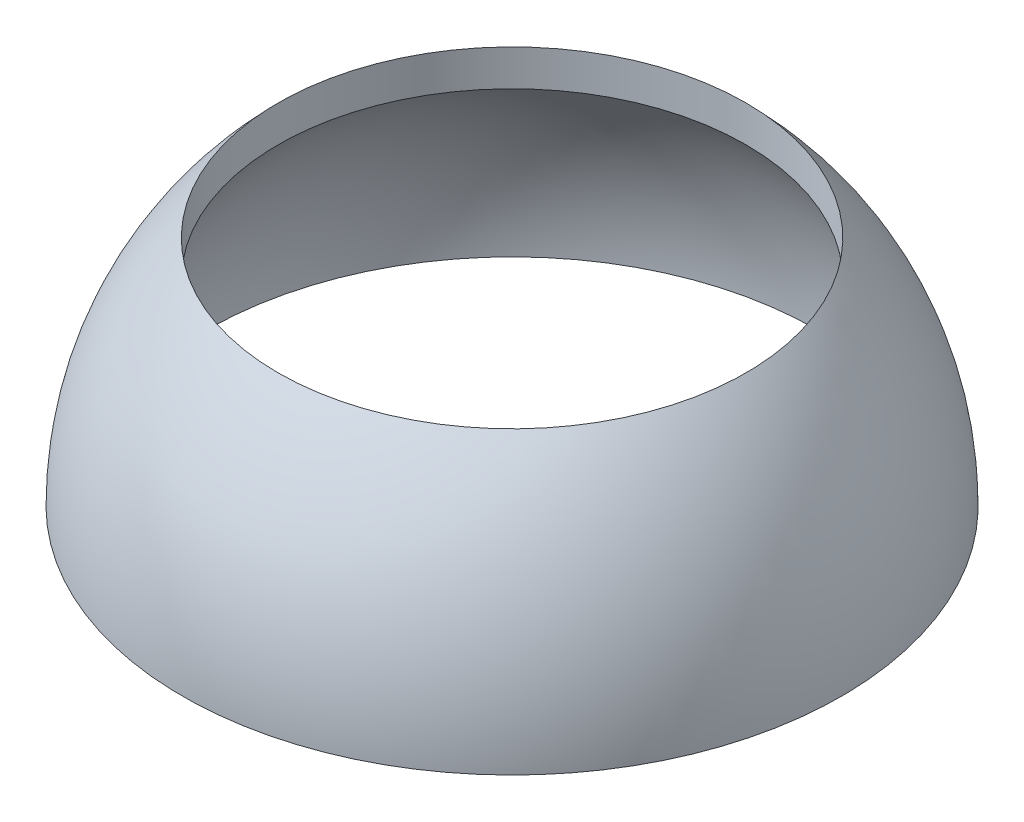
ISO-10303-21;
HEADER;
FILE_DESCRIPTION(('STEP AP214'),'2;1');
FILE_NAME('part.step','',(''),(''),'','','');
FILE_SCHEMA(('AUTOMOTIVE_DESIGN { 1 0 10303 214 1 1 1 1 }'));
ENDSEC;
DATA;
#1=APPLICATION_CONTEXT('core data for automotive mechanical design processes');
#2=APPLICATION_PROTOCOL_DEFINITION('international standard','automotive_design',2000,#1);
#3=PRODUCT_CONTEXT('',#1,'mechanical');
#4=PRODUCT('Part','Part','',(#3));
#5=PRODUCT_RELATED_PRODUCT_CATEGORY('part','',(#4));
#6=PRODUCT_DEFINITION_FORMATION('','',#4);
#7=PRODUCT_DEFINITION_CONTEXT('part definition',#1,'design');
#8=PRODUCT_DEFINITION('design','',#6,#7);
#9=PRODUCT_DEFINITION_SHAPE('','',#8);
#10=(LENGTH_UNIT() NAMED_UNIT(*) SI_UNIT(.MILLI.,.METRE.));
#11=(NAMED_UNIT(*) PLANE_ANGLE_UNIT() SI_UNIT($,.RADIAN.));
#12=(NAMED_UNIT(*) SI_UNIT($,.STERADIAN.) SOLID_ANGLE_UNIT());
#13=UNCERTAINTY_MEASURE_WITH_UNIT(LENGTH_MEASURE(1.E-05),#10,'distance_accuracy_value','');
#14=(GEOMETRIC_REPRESENTATION_CONTEXT(3) GLOBAL_UNCERTAINTY_ASSIGNED_CONTEXT((#13)) GLOBAL_UNIT_ASSIGNED_CONTEXT((#10,
#11,#12)) REPRESENTATION_CONTEXT('',''));
#15=CARTESIAN_POINT('',(0.,0.,0.));
#16=DIRECTION('',(0.,0.,1.));
#17=DIRECTION('',(1.,0.,0.));
#18=AXIS2_PLACEMENT_3D('',#15,#16,#17);
#19=CARTESIAN_POINT('',(0.,0.,0.));
#20=DIRECTION('',(0.,-1.,0.));
#21=DIRECTION('',(1.,0.,0.));
#22=AXIS2_PLACEMENT_3D('',#19,#20,#21);
#23=SPHERICAL_SURFACE('',#22,14.35);
#24=CARTESIAN_POINT('',(0.,9.21534047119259,0.));
#25=DIRECTION('',(0.,-1.,0.));
#26=DIRECTION('',(0.,0.,-1.));
#27=AXIS2_PLACEMENT_3D('',#24,#25,#26);
#28=CIRCLE('',#27,11.);
#29=CARTESIAN_POINT('',(0.,9.21534047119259,-11.));
#30=VERTEX_POINT('',#29);
#31=EDGE_CURVE('E39',#30,#30,#28,.F.);
#32=ORIENTED_EDGE('',*,*,#31,.T.);
#33=EDGE_LOOP('',(#32));
#34=FACE_BOUND('',#33,.T.);
#35=CARTESIAN_POINT('',(0.,0.,0.));
#36=DIRECTION('',(0.,-1.,0.));
#37=DIRECTION('',(0.,0.,-1.));
#38=AXIS2_PLACEMENT_3D('',#35,#36,#37);
#39=CIRCLE('',#38,14.35);
#40=CARTESIAN_POINT('',(0.,0.,-14.35));
#41=VERTEX_POINT('',#40);
#42=EDGE_CURVE('E10',#41,#41,#39,.T.);
#43=ORIENTED_EDGE('',*,*,#42,.T.);
#44=EDGE_LOOP('',(#43));
#45=FACE_BOUND('',#44,.T.);
#46=ADVANCED_FACE('F29',(#34,#45),#23,.F.);
#47=CARTESIAN_POINT('',(14.35,0.,0.));
#48=DIRECTION('',(0.,-1.,0.));
#49=DIRECTION('',(0.,0.,-1.));
#50=AXIS2_PLACEMENT_3D('',#47,#48,#49);
#51=PLANE('',#50);
#52=CARTESIAN_POINT('',(0.,0.,0.));
#53=DIRECTION('',(0.,-1.,0.));
#54=DIRECTION('',(0.,0.,-1.));
#55=AXIS2_PLACEMENT_3D('',#52,#53,#54);
#56=CIRCLE('',#55,15.5);
#57=CARTESIAN_POINT('',(0.,0.,-15.5));
#58=VERTEX_POINT('',#57);
#59=EDGE_CURVE('E35',#58,#58,#56,.T.);
#60=ORIENTED_EDGE('',*,*,#59,.T.);
#61=EDGE_LOOP('',(#60));
#62=FACE_BOUND('',#61,.T.);
#63=ORIENTED_EDGE('',*,*,#42,.F.);
#64=EDGE_LOOP('',(#63));
#65=FACE_BOUND('',#64,.T.);
#66=ADVANCED_FACE('F59',(#62,#65),#51,.T.);
#67=CARTESIAN_POINT('',(0.,0.,0.));
#68=DIRECTION('',(0.,-1.,0.));
#69=DIRECTION('',(1.,0.,0.));
#70=AXIS2_PLACEMENT_3D('',#67,#68,#69);
#71=SPHERICAL_SURFACE('',#70,15.5);
#72=CARTESIAN_POINT('',(0.,10.9201648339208,0.));
#73=DIRECTION('',(0.,-1.,0.));
#74=DIRECTION('',(0.,0.,-1.));
#75=AXIS2_PLACEMENT_3D('',#72,#73,#74);
#76=CIRCLE('',#75,11.);
#77=CARTESIAN_POINT('',(0.,10.9201648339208,-11.));
#78=VERTEX_POINT('',#77);
#79=EDGE_CURVE('E43',#78,#78,#76,.T.);
#80=ORIENTED_EDGE('',*,*,#79,.T.);
#81=EDGE_LOOP('',(#80));
#82=FACE_BOUND('',#81,.T.);
#83=ORIENTED_EDGE('',*,*,#59,.F.);
#84=EDGE_LOOP('',(#83));
#85=FACE_BOUND('',#84,.T.);
#86=ADVANCED_FACE('F49',(#82,#85),#71,.T.);
#87=CARTESIAN_POINT('',(0.,15.501,0.));
#88=DIRECTION('',(0.,-1.,0.));
#89=DIRECTION('',(0.,0.,-1.));
#90=AXIS2_PLACEMENT_3D('',#87,#88,#89);
#91=CYLINDRICAL_SURFACE('',#90,11.);
#92=ORIENTED_EDGE('',*,*,#31,.F.);
#93=EDGE_LOOP('',(#92));
#94=FACE_BOUND('',#93,.T.);
#95=ORIENTED_EDGE('',*,*,#79,.F.);
#96=EDGE_LOOP('',(#95));
#97=FACE_BOUND('',#96,.T.);
#98=ADVANCED_FACE('F52',(#94,#97),#91,.F.);
#99=CLOSED_SHELL('',(#46,#66,#86,#98));
#100=MANIFOLD_SOLID_BREP('B2',#99);
#101=ADVANCED_BREP_SHAPE_REPRESENTATION('',(#18,#100),#14);
#102=SHAPE_DEFINITION_REPRESENTATION(#9,#101);
ENDSEC;
END-ISO-10303-21;
